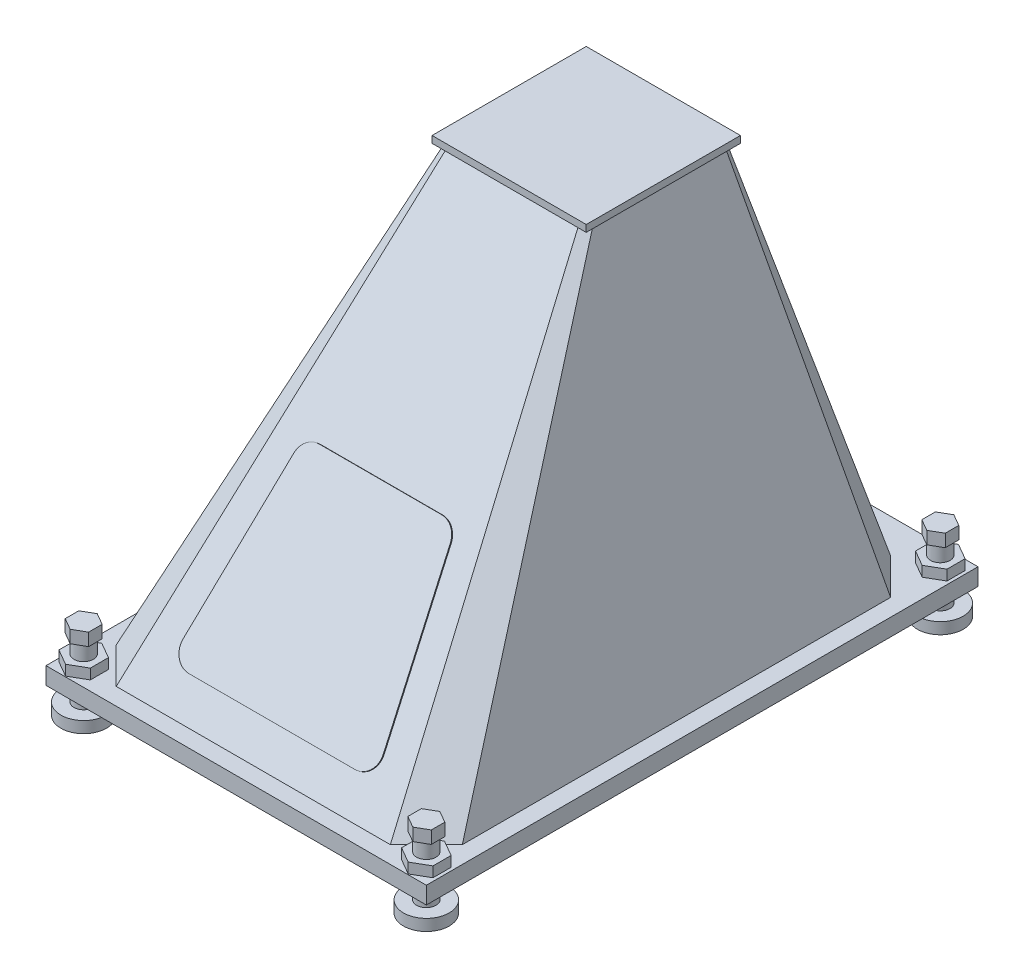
from build123d import *

# Parameters (mm, degrees)
SKIZZE1_W                            = 666
SKIZZE1_H                            = 966
AUFSATZ_LINEAR_AUSTRAGEN1_DEPTH      = 30
SKIZZE11_W                           = 270
SKIZZE11_H                           = 270
AUFSATZ_LINEAR_AUSTRAGEN8_DEPTH      = 12
AUFSATZ_LINEAR_AUSTRAGEN4_DEPTH      = 25
AUFSATZ_LINEAR_AUSTRAGEN4_DEPTH_BACK = 75
SKIZZE6_R                            = 17
AUFSATZ_LINEAR_AUSTRAGEN5_DEPTH      = 22
AUFSATZ_LINEAR_AUSTRAGEN6_DEPTH      = 18
SKIZZE9_R                            = 40
AUFSATZ_LINEAR_AUSTRAGEN7_DEPTH      = 20
AUFSATZ_LINEAR_AUSTRAGEN9_DEPTH      = 2


with BuildPart() as part:
    # Skizze1 → Aufsatz-Linear austragen1 (new body)
    with BuildSketch(Plane(origin=(0, 0, 0), x_dir=(1, 0, 0), z_dir=(0, 1, 0))):
        with Locations((0, -130)):
            Rectangle(SKIZZE1_W, SKIZZE1_H)
    extrude(amount=AUFSATZ_LINEAR_AUSTRAGEN1_DEPTH)

    # Skizze10 → Ausformung1 section 0
    with BuildSketch(Plane(origin=(0, 682, 0), x_dir=(1, 0, 0), z_dir=(0, 1, 0))):
        with BuildLine():
            Line((-115.5, 128), (115.5, 128))
            Line((115.5, 128), (128, 115.5))
            Line((128, 115.5), (128, -115.5))
            Line((128, -115.5), (115.5, -128))
            Line((115.5, -128), (-115.5, -128))
            Line((-115.5, -128), (-128, -115.5))
            Line((-128, -115.5), (-128, 115.5))
            Line((-128, 115.5), (-115.5, 128))
        make_face()
    # Skizze2 → Ausformung1 section 1
    with BuildSketch(Plane(origin=(0, 30, 0), x_dir=(1, 0, 0), z_dir=(0, 1, 0))):
        with BuildLine():
            Line((-240, 293), (240, 293))
            Line((240, 293), (303, 230))
            Line((303, 230), (303, -520))
            Line((303, -520), (240, -583))
            Line((240, -583), (-240, -583))
            Line((-240, -583), (-303, -520))
            Line((-303, -520), (-303, 230))
            Line((-303, 230), (-240, 293))
        make_face()
    loft()

    # Skizze11 → Aufsatz-Linear austragen8 (add)
    with BuildSketch(Plane(origin=(0, 682, 0), x_dir=(1, 0, 0), z_dir=(0, 1, 0))):
        Rectangle(SKIZZE11_W, SKIZZE11_H)
    extrude(amount=AUFSATZ_LINEAR_AUSTRAGEN8_DEPTH)

    # Skizze6 → Aufsatz-Linear austragen4 (add, two sides: drawn at the far end of the back side and taken through both)
    with BuildSketch(Plane.XZ.offset(-AUFSATZ_LINEAR_AUSTRAGEN4_DEPTH_BACK)):
        with Locations(Location((-300, 580, 0), (0, 0, 270))):
            Circle(SKIZZE6_R)
        with Locations(Location((300, 580, 0), (0, 0, 270))):
            Circle(SKIZZE6_R)
        with Locations(Location((300, -320, 0), (0, 0, 270))):
            Circle(SKIZZE6_R)
        with Locations(Location((-300, -320, 0), (0, 0, 270))):
            Circle(SKIZZE6_R)
    extrude(amount=AUFSATZ_LINEAR_AUSTRAGEN4_DEPTH + AUFSATZ_LINEAR_AUSTRAGEN4_DEPTH_BACK)

    # Skizze7 → Aufsatz-Linear austragen5 (add)
    with BuildSketch(Plane(origin=(0, 75, 0), x_dir=(1, 0, 0), z_dir=(0, 1, 0))):
        Polygon((-300, 343.671361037), (-320.5, 331.835680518), (-320.5, 308.164319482), (-300, 296.328638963), (-279.5, 308.164319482), (-279.5, 331.835680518), align=None)
        Polygon((300, 343.671361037), (279.5, 331.835680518), (279.5, 308.164319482), (300, 296.328638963), (320.5, 308.164319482), (320.5, 331.835680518), align=None)
        Polygon((300, -556.328638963), (279.5, -568.164319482), (279.5, -591.835680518), (300, -603.671361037), (320.5, -591.835680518), (320.5, -568.164319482), align=None)
        Polygon((-300, -556.328638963), (-320.5, -568.164319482), (-320.5, -591.835680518), (-300, -603.671361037), (-279.5, -591.835680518), (-279.5, -568.164319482), align=None)
    extrude(amount=AUFSATZ_LINEAR_AUSTRAGEN5_DEPTH)

    # Skizze8 → Aufsatz-Linear austragen6 (add)
    with BuildSketch(Plane(origin=(0, 30, 0), x_dir=(1, 0, 0), z_dir=(0, 1, 0))):
        Polygon((-300, -611.754264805), (-272.5, -595.877132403), (-272.5, -564.122867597), (-300, -548.245735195), (-327.5, -564.122867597), (-327.5, -595.877132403), align=None)
        Polygon((300, -611.754264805), (327.5, -595.877132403), (327.5, -564.122867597), (300, -548.245735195), (272.5, -564.122867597), (272.5, -595.877132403), align=None)
        Polygon((300, 288.245735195), (327.5, 304.122867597), (327.5, 335.877132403), (300, 351.754264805), (272.5, 335.877132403), (272.5, 304.122867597), align=None)
        Polygon((-300, 288.245735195), (-272.5, 304.122867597), (-272.5, 335.877132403), (-300, 351.754264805), (-327.5, 335.877132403), (-327.5, 304.122867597), align=None)
    extrude(amount=AUFSATZ_LINEAR_AUSTRAGEN6_DEPTH)

    # Skizze9 → Aufsatz-Linear austragen7 (add)
    with BuildSketch(Plane.XZ.offset(25)):
        with Locations(Location((-300, 580, 0), (0, 0, 90))):
            Circle(SKIZZE9_R)
        with Locations(Location((300, 580, 0), (0, 0, 90))):
            Circle(SKIZZE9_R)
        with Locations(Location((300, -320, 0), (0, 0, 90))):
            Circle(SKIZZE9_R)
        with Locations(Location((-300, -320, 0), (0, 0, 90))):
            Circle(SKIZZE9_R)
    extrude(amount=AUFSATZ_LINEAR_AUSTRAGEN7_DEPTH)

    # Skizze12 → Aufsatz-Linear austragen9 (add)
    with BuildSketch(Plane(origin=(0, 283.428746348, 406.144049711), x_dir=(1, 0, 0), z_dir=(0, 0.5722799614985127, 0.8200583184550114))):
        with BuildLine():
            Line((-145.488947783, -249.037468), (145.488947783, -249.037468))
            ThreePointArc((145.488947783, -249.037468), (168.13023519, -238.71923887), (175.196989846, -214.862274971))
            Line((175.196989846, -214.862274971), (136.969882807, 57.137725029))
            ThreePointArc((136.969882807, 57.137725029), (126.943611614, 75.603819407), (107.261840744, 82.962532))
            Line((107.261840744, 82.962532), (-107.261840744, 82.962532))
            ThreePointArc((-107.261840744, 82.962532), (-126.943611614, 75.603819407), (-136.969882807, 57.137725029))
            Line((-136.969882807, 57.137725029), (-175.196989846, -214.862274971))
            ThreePointArc((-175.196989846, -214.862274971), (-168.13023519, -238.71923887), (-145.488947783, -249.037468))
        make_face()
    extrude(amount=AUFSATZ_LINEAR_AUSTRAGEN9_DEPTH)


solid = part.part
